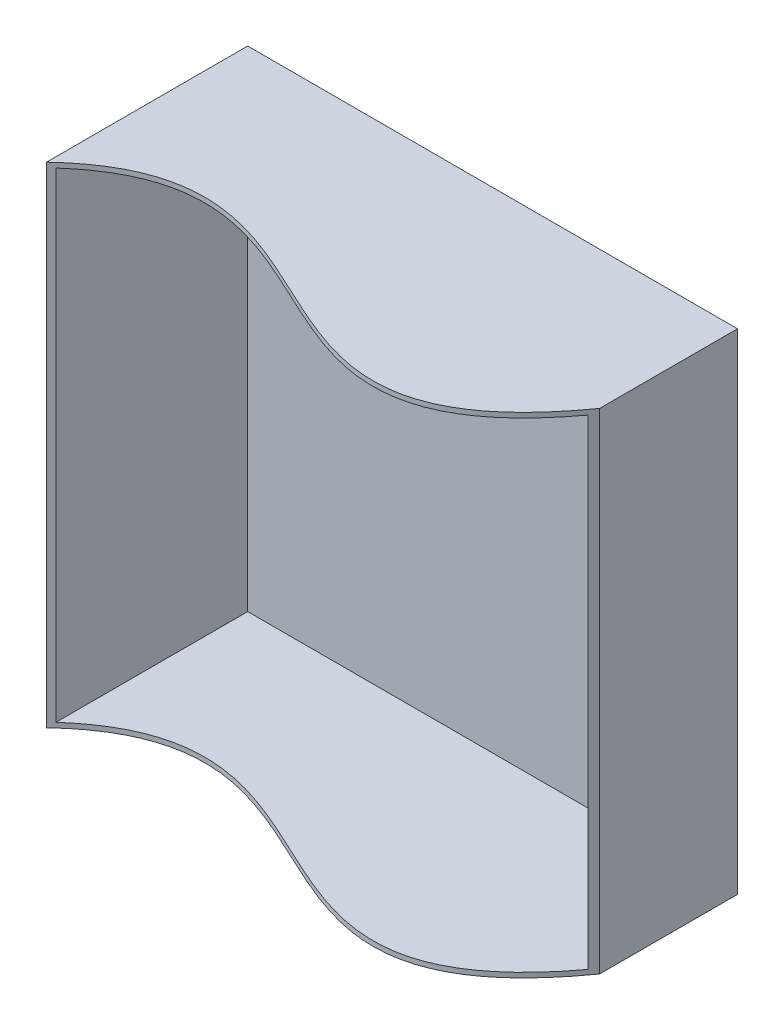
ISO-10303-21;
HEADER;
FILE_DESCRIPTION(('STEP AP214'),'2;1');
FILE_NAME('part.step','',(''),(''),'','','');
FILE_SCHEMA(('AUTOMOTIVE_DESIGN { 1 0 10303 214 1 1 1 1 }'));
ENDSEC;
DATA;
#1=APPLICATION_CONTEXT('core data for automotive mechanical design processes');
#2=APPLICATION_PROTOCOL_DEFINITION('international standard','automotive_design',2000,#1);
#3=PRODUCT_CONTEXT('',#1,'mechanical');
#4=PRODUCT('Part','Part','',(#3));
#5=PRODUCT_RELATED_PRODUCT_CATEGORY('part','',(#4));
#6=PRODUCT_DEFINITION_FORMATION('','',#4);
#7=PRODUCT_DEFINITION_CONTEXT('part definition',#1,'design');
#8=PRODUCT_DEFINITION('design','',#6,#7);
#9=PRODUCT_DEFINITION_SHAPE('','',#8);
#10=(LENGTH_UNIT() NAMED_UNIT(*) SI_UNIT(.MILLI.,.METRE.));
#11=(NAMED_UNIT(*) PLANE_ANGLE_UNIT() SI_UNIT($,.RADIAN.));
#12=(NAMED_UNIT(*) SI_UNIT($,.STERADIAN.) SOLID_ANGLE_UNIT());
#13=UNCERTAINTY_MEASURE_WITH_UNIT(LENGTH_MEASURE(1.E-05),#10,'distance_accuracy_value','');
#14=(GEOMETRIC_REPRESENTATION_CONTEXT(3) GLOBAL_UNCERTAINTY_ASSIGNED_CONTEXT((#13)) GLOBAL_UNIT_ASSIGNED_CONTEXT((#10,
#11,#12)) REPRESENTATION_CONTEXT('',''));
#15=CARTESIAN_POINT('',(0.,0.,0.));
#16=DIRECTION('',(0.,0.,1.));
#17=DIRECTION('',(1.,0.,0.));
#18=AXIS2_PLACEMENT_3D('',#15,#16,#17);
#19=CARTESIAN_POINT('',(50.,-50.,100.));
#20=DIRECTION('',(-1.,0.,0.));
#21=DIRECTION('',(0.,0.,1.));
#22=AXIS2_PLACEMENT_3D('',#19,#20,#21);
#23=PLANE('',#22);
#24=DIRECTION('',(0.,0.,-1.));
#25=VECTOR('',#24,1.);
#26=CARTESIAN_POINT('',(50.,50.,100.));
#27=LINE('',#26,#25);
#28=CARTESIAN_POINT('',(50.,50.,28.1553530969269));
#29=VERTEX_POINT('',#28);
#30=CARTESIAN_POINT('',(50.,50.,0.));
#31=VERTEX_POINT('',#30);
#32=EDGE_CURVE('E44',#29,#31,#27,.T.);
#33=ORIENTED_EDGE('',*,*,#32,.F.);
#34=DIRECTION('',(0.,1.,0.));
#35=VECTOR('',#34,1.);
#36=CARTESIAN_POINT('',(50.,-50.,28.1553530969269));
#37=LINE('',#36,#35);
#38=CARTESIAN_POINT('',(50.,-50.,28.1553530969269));
#39=VERTEX_POINT('',#38);
#40=EDGE_CURVE('E100',#39,#29,#37,.T.);
#41=ORIENTED_EDGE('',*,*,#40,.F.);
#42=DIRECTION('',(0.,0.,-1.));
#43=VECTOR('',#42,1.);
#44=CARTESIAN_POINT('',(50.,-50.,100.));
#45=LINE('',#44,#43);
#46=CARTESIAN_POINT('',(50.,-50.,0.));
#47=VERTEX_POINT('',#46);
#48=EDGE_CURVE('E110',#39,#47,#45,.T.);
#49=ORIENTED_EDGE('',*,*,#48,.T.);
#50=DIRECTION('',(0.,1.,0.));
#51=VECTOR('',#50,1.);
#52=CARTESIAN_POINT('',(50.,-50.,0.));
#53=LINE('',#52,#51);
#54=EDGE_CURVE('E135',#47,#31,#53,.T.);
#55=ORIENTED_EDGE('',*,*,#54,.T.);
#56=EDGE_LOOP('',(#33,#41,#49,#55));
#57=FACE_BOUND('',#56,.T.);
#58=ADVANCED_FACE('F35',(#57),#23,.F.);
#59=CARTESIAN_POINT('',(-50.,50.,100.));
#60=DIRECTION('',(0.,-1.,0.));
#61=DIRECTION('',(0.,0.,-1.));
#62=AXIS2_PLACEMENT_3D('',#59,#60,#61);
#63=PLANE('',#62);
#64=DIRECTION('',(0.,0.,-1.));
#65=VECTOR('',#64,1.);
#66=CARTESIAN_POINT('',(-50.,50.,100.));
#67=LINE('',#66,#65);
#68=CARTESIAN_POINT('',(-50.,50.,41.0775385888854));
#69=VERTEX_POINT('',#68);
#70=CARTESIAN_POINT('',(-50.,50.,0.));
#71=VERTEX_POINT('',#70);
#72=EDGE_CURVE('E120',#69,#71,#67,.T.);
#73=ORIENTED_EDGE('',*,*,#72,.F.);
#74=CARTESIAN_POINT('',(50.,50.,28.1553530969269));
#75=CARTESIAN_POINT('',(14.5301264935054,50.,77.941452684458));
#76=CARTESIAN_POINT('',(-13.036398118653,50.,6.22595688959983));
#77=CARTESIAN_POINT('',(-50.,50.,41.0775385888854));
#78=B_SPLINE_CURVE_WITH_KNOTS('',3,(#74,#75,#76,#77),.UNSPECIFIED.,.F.,.F.,(4,4),(0.,1.),.UNSPECIFIED.);
#79=EDGE_CURVE('E105',#29,#69,#78,.T.);
#80=ORIENTED_EDGE('',*,*,#79,.F.);
#81=ORIENTED_EDGE('',*,*,#32,.T.);
#82=DIRECTION('',(-1.,0.,0.));
#83=VECTOR('',#82,1.);
#84=CARTESIAN_POINT('',(-50.,50.,0.));
#85=LINE('',#84,#83);
#86=EDGE_CURVE('E131',#31,#71,#85,.T.);
#87=ORIENTED_EDGE('',*,*,#86,.T.);
#88=EDGE_LOOP('',(#73,#80,#81,#87));
#89=FACE_BOUND('',#88,.T.);
#90=ADVANCED_FACE('F130',(#89),#63,.F.);
#91=CARTESIAN_POINT('',(-50.,-50.,100.));
#92=DIRECTION('',(1.,0.,0.));
#93=DIRECTION('',(0.,0.,-1.));
#94=AXIS2_PLACEMENT_3D('',#91,#92,#93);
#95=PLANE('',#94);
#96=DIRECTION('',(0.,0.,-1.));
#97=VECTOR('',#96,1.);
#98=CARTESIAN_POINT('',(-50.,-50.,100.));
#99=LINE('',#98,#97);
#100=CARTESIAN_POINT('',(-50.,-50.,41.0775385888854));
#101=VERTEX_POINT('',#100);
#102=CARTESIAN_POINT('',(-50.,-50.,0.));
#103=VERTEX_POINT('',#102);
#104=EDGE_CURVE('E118',#101,#103,#99,.T.);
#105=ORIENTED_EDGE('',*,*,#104,.F.);
#106=DIRECTION('',(0.,1.,0.));
#107=VECTOR('',#106,1.);
#108=CARTESIAN_POINT('',(-50.,-50.,41.0775385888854));
#109=LINE('',#108,#107);
#110=EDGE_CURVE('E51',#101,#69,#109,.T.);
#111=ORIENTED_EDGE('',*,*,#110,.T.);
#112=ORIENTED_EDGE('',*,*,#72,.T.);
#113=DIRECTION('',(0.,-1.,0.));
#114=VECTOR('',#113,1.);
#115=CARTESIAN_POINT('',(-50.,-50.,0.));
#116=LINE('',#115,#114);
#117=EDGE_CURVE('E122',#71,#103,#116,.T.);
#118=ORIENTED_EDGE('',*,*,#117,.T.);
#119=EDGE_LOOP('',(#105,#111,#112,#118));
#120=FACE_BOUND('',#119,.T.);
#121=ADVANCED_FACE('F146',(#120),#95,.F.);
#122=CARTESIAN_POINT('',(-50.,-50.,100.));
#123=DIRECTION('',(0.,1.,0.));
#124=DIRECTION('',(0.,0.,1.));
#125=AXIS2_PLACEMENT_3D('',#122,#123,#124);
#126=PLANE('',#125);
#127=ORIENTED_EDGE('',*,*,#48,.F.);
#128=CARTESIAN_POINT('',(50.,-50.,28.1553530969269));
#129=CARTESIAN_POINT('',(14.5301264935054,-50.,77.941452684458));
#130=CARTESIAN_POINT('',(-13.036398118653,-50.,6.22595688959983));
#131=CARTESIAN_POINT('',(-50.,-50.,41.0775385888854));
#132=B_SPLINE_CURVE_WITH_KNOTS('',3,(#128,#129,#130,#131),.UNSPECIFIED.,.F.,.F.,(4,4),(0.,1.),.UNSPECIFIED.);
#133=EDGE_CURVE('E97',#39,#101,#132,.T.);
#134=ORIENTED_EDGE('',*,*,#133,.T.);
#135=ORIENTED_EDGE('',*,*,#104,.T.);
#136=DIRECTION('',(1.,0.,0.));
#137=VECTOR('',#136,1.);
#138=CARTESIAN_POINT('',(-50.,-50.,0.));
#139=LINE('',#138,#137);
#140=EDGE_CURVE('E116',#103,#47,#139,.T.);
#141=ORIENTED_EDGE('',*,*,#140,.T.);
#142=EDGE_LOOP('',(#127,#134,#135,#141));
#143=FACE_BOUND('',#142,.T.);
#144=ADVANCED_FACE('F114',(#143),#126,.F.);
#145=CARTESIAN_POINT('',(50.,50.,0.));
#146=DIRECTION('',(0.,0.,-1.));
#147=DIRECTION('',(-1.,0.,0.));
#148=AXIS2_PLACEMENT_3D('',#145,#146,#147);
#149=PLANE('',#148);
#150=ORIENTED_EDGE('',*,*,#54,.F.);
#151=ORIENTED_EDGE('',*,*,#140,.F.);
#152=ORIENTED_EDGE('',*,*,#117,.F.);
#153=ORIENTED_EDGE('',*,*,#86,.F.);
#154=EDGE_LOOP('',(#150,#151,#152,#153));
#155=FACE_BOUND('',#154,.T.);
#156=ADVANCED_FACE('F134',(#155),#149,.T.);
#157=DIRECTION('',(0.,1.,0.));
#158=VECTOR('',#157,1.);
#159=SURFACE_OF_LINEAR_EXTRUSION('',#132,#158);
#160=DIRECTION('',(0.,1.,0.));
#161=VECTOR('',#160,1.);
#162=CARTESIAN_POINT('',(49.,-50.,29.5297651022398));
#163=LINE('',#162,#161);
#164=CARTESIAN_POINT('',(49.000000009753,49.,29.5297650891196));
#165=VERTEX_POINT('',#164);
#166=CARTESIAN_POINT('',(49.,-49.,29.5297650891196));
#167=VERTEX_POINT('',#166);
#168=EDGE_CURVE('E58',#165,#167,#163,.F.);
#169=ORIENTED_EDGE('',*,*,#168,.T.);
#170=CARTESIAN_POINT('',(50.,-49.,28.1553530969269));
#171=CARTESIAN_POINT('',(14.5301264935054,-49.,77.941452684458));
#172=CARTESIAN_POINT('',(-13.036398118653,-49.,6.22595688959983));
#173=CARTESIAN_POINT('',(-50.,-49.,41.0775385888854));
#174=B_SPLINE_CURVE_WITH_KNOTS('',3,(#170,#171,#172,#173),.UNSPECIFIED.,.F.,.F.,(4,4),(0.,1.),.UNSPECIFIED.);
#175=CARTESIAN_POINT('',(-49.0000000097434,-49.,40.1584666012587));
#176=VERTEX_POINT('',#175);
#177=EDGE_CURVE('E11',#167,#176,#174,.T.);
#178=ORIENTED_EDGE('',*,*,#177,.T.);
#179=DIRECTION('',(0.,1.,0.));
#180=VECTOR('',#179,1.);
#181=CARTESIAN_POINT('',(-49.,-50.,40.1584665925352));
#182=LINE('',#181,#180);
#183=CARTESIAN_POINT('',(-49.,49.,40.1584665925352));
#184=VERTEX_POINT('',#183);
#185=EDGE_CURVE('E112',#176,#184,#182,.T.);
#186=ORIENTED_EDGE('',*,*,#185,.T.);
#187=CARTESIAN_POINT('',(50.,49.,28.1553530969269));
#188=CARTESIAN_POINT('',(14.5301264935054,49.,77.941452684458));
#189=CARTESIAN_POINT('',(-13.036398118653,49.,6.22595688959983));
#190=CARTESIAN_POINT('',(-50.,49.,41.0775385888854));
#191=B_SPLINE_CURVE_WITH_KNOTS('',3,(#187,#188,#189,#190),.UNSPECIFIED.,.F.,.F.,(4,4),(0.,1.),.UNSPECIFIED.);
#192=EDGE_CURVE('E151',#184,#165,#191,.F.);
#193=ORIENTED_EDGE('',*,*,#192,.T.);
#194=EDGE_LOOP('',(#169,#178,#186,#193));
#195=FACE_BOUND('',#194,.T.);
#196=ORIENTED_EDGE('',*,*,#79,.T.);
#197=ORIENTED_EDGE('',*,*,#110,.F.);
#198=ORIENTED_EDGE('',*,*,#133,.F.);
#199=ORIENTED_EDGE('',*,*,#40,.T.);
#200=EDGE_LOOP('',(#196,#197,#198,#199));
#201=FACE_BOUND('',#200,.T.);
#202=ADVANCED_FACE('F99',(#195,#201),#159,.F.);
#203=CARTESIAN_POINT('',(50.,50.,1.));
#204=DIRECTION('',(0.,0.,-1.));
#205=DIRECTION('',(-1.,0.,0.));
#206=AXIS2_PLACEMENT_3D('',#203,#204,#205);
#207=PLANE('',#206);
#208=DIRECTION('',(0.,1.,0.));
#209=VECTOR('',#208,1.);
#210=CARTESIAN_POINT('',(49.,50.,1.));
#211=LINE('',#210,#209);
#212=CARTESIAN_POINT('',(49.,-49.,1.));
#213=VERTEX_POINT('',#212);
#214=CARTESIAN_POINT('',(49.,49.,1.));
#215=VERTEX_POINT('',#214);
#216=EDGE_CURVE('E159',#213,#215,#211,.T.);
#217=ORIENTED_EDGE('',*,*,#216,.T.);
#218=DIRECTION('',(-1.,0.,0.));
#219=VECTOR('',#218,1.);
#220=CARTESIAN_POINT('',(50.,49.,1.));
#221=LINE('',#220,#219);
#222=CARTESIAN_POINT('',(-49.,49.,1.));
#223=VERTEX_POINT('',#222);
#224=EDGE_CURVE('E161',#215,#223,#221,.T.);
#225=ORIENTED_EDGE('',*,*,#224,.T.);
#226=DIRECTION('',(0.,-1.,0.));
#227=VECTOR('',#226,1.);
#228=CARTESIAN_POINT('',(-49.,50.,1.));
#229=LINE('',#228,#227);
#230=CARTESIAN_POINT('',(-49.,-49.,1.));
#231=VERTEX_POINT('',#230);
#232=EDGE_CURVE('E168',#223,#231,#229,.T.);
#233=ORIENTED_EDGE('',*,*,#232,.T.);
#234=DIRECTION('',(1.,0.,0.));
#235=VECTOR('',#234,1.);
#236=CARTESIAN_POINT('',(50.,-49.,1.));
#237=LINE('',#236,#235);
#238=EDGE_CURVE('E143',#231,#213,#237,.T.);
#239=ORIENTED_EDGE('',*,*,#238,.T.);
#240=EDGE_LOOP('',(#217,#225,#233,#239));
#241=FACE_BOUND('',#240,.T.);
#242=ADVANCED_FACE('F181',(#241),#207,.F.);
#243=CARTESIAN_POINT('',(-50.,-49.,100.));
#244=DIRECTION('',(0.,1.,0.));
#245=DIRECTION('',(0.,0.,1.));
#246=AXIS2_PLACEMENT_3D('',#243,#244,#245);
#247=PLANE('',#246);
#248=ORIENTED_EDGE('',*,*,#177,.F.);
#249=DIRECTION('',(0.,0.,-1.));
#250=VECTOR('',#249,1.);
#251=CARTESIAN_POINT('',(49.,-49.,100.));
#252=LINE('',#251,#250);
#253=EDGE_CURVE('E163',#167,#213,#252,.T.);
#254=ORIENTED_EDGE('',*,*,#253,.T.);
#255=ORIENTED_EDGE('',*,*,#238,.F.);
#256=DIRECTION('',(0.,0.,-1.));
#257=VECTOR('',#256,1.);
#258=CARTESIAN_POINT('',(-49.,-49.,100.));
#259=LINE('',#258,#257);
#260=EDGE_CURVE('E165',#176,#231,#259,.T.);
#261=ORIENTED_EDGE('',*,*,#260,.F.);
#262=EDGE_LOOP('',(#248,#254,#255,#261));
#263=FACE_BOUND('',#262,.T.);
#264=ADVANCED_FACE('F184',(#263),#247,.T.);
#265=CARTESIAN_POINT('',(-49.,-50.,100.));
#266=DIRECTION('',(1.,0.,0.));
#267=DIRECTION('',(0.,0.,-1.));
#268=AXIS2_PLACEMENT_3D('',#265,#266,#267);
#269=PLANE('',#268);
#270=ORIENTED_EDGE('',*,*,#185,.F.);
#271=ORIENTED_EDGE('',*,*,#260,.T.);
#272=ORIENTED_EDGE('',*,*,#232,.F.);
#273=DIRECTION('',(0.,0.,-1.));
#274=VECTOR('',#273,1.);
#275=CARTESIAN_POINT('',(-49.,49.,100.));
#276=LINE('',#275,#274);
#277=EDGE_CURVE('E140',#184,#223,#276,.T.);
#278=ORIENTED_EDGE('',*,*,#277,.F.);
#279=EDGE_LOOP('',(#270,#271,#272,#278));
#280=FACE_BOUND('',#279,.T.);
#281=ADVANCED_FACE('F175',(#280),#269,.T.);
#282=CARTESIAN_POINT('',(-50.,49.,100.));
#283=DIRECTION('',(0.,-1.,0.));
#284=DIRECTION('',(0.,0.,-1.));
#285=AXIS2_PLACEMENT_3D('',#282,#283,#284);
#286=PLANE('',#285);
#287=ORIENTED_EDGE('',*,*,#192,.F.);
#288=ORIENTED_EDGE('',*,*,#277,.T.);
#289=ORIENTED_EDGE('',*,*,#224,.F.);
#290=DIRECTION('',(0.,0.,-1.));
#291=VECTOR('',#290,1.);
#292=CARTESIAN_POINT('',(49.,49.,100.));
#293=LINE('',#292,#291);
#294=EDGE_CURVE('E138',#165,#215,#293,.T.);
#295=ORIENTED_EDGE('',*,*,#294,.F.);
#296=EDGE_LOOP('',(#287,#288,#289,#295));
#297=FACE_BOUND('',#296,.T.);
#298=ADVANCED_FACE('F191',(#297),#286,.T.);
#299=CARTESIAN_POINT('',(49.,-50.,100.));
#300=DIRECTION('',(-1.,0.,0.));
#301=DIRECTION('',(0.,0.,1.));
#302=AXIS2_PLACEMENT_3D('',#299,#300,#301);
#303=PLANE('',#302);
#304=ORIENTED_EDGE('',*,*,#168,.F.);
#305=ORIENTED_EDGE('',*,*,#294,.T.);
#306=ORIENTED_EDGE('',*,*,#216,.F.);
#307=ORIENTED_EDGE('',*,*,#253,.F.);
#308=EDGE_LOOP('',(#304,#305,#306,#307));
#309=FACE_BOUND('',#308,.T.);
#310=ADVANCED_FACE('F187',(#309),#303,.T.);
#311=CLOSED_SHELL('',(#58,#90,#121,#144,#156,#202,#242,#264,#281,#298,#310));
#312=MANIFOLD_SOLID_BREP('B2',#311);
#313=ADVANCED_BREP_SHAPE_REPRESENTATION('',(#18,#312),#14);
#314=SHAPE_DEFINITION_REPRESENTATION(#9,#313);
ENDSEC;
END-ISO-10303-21;
